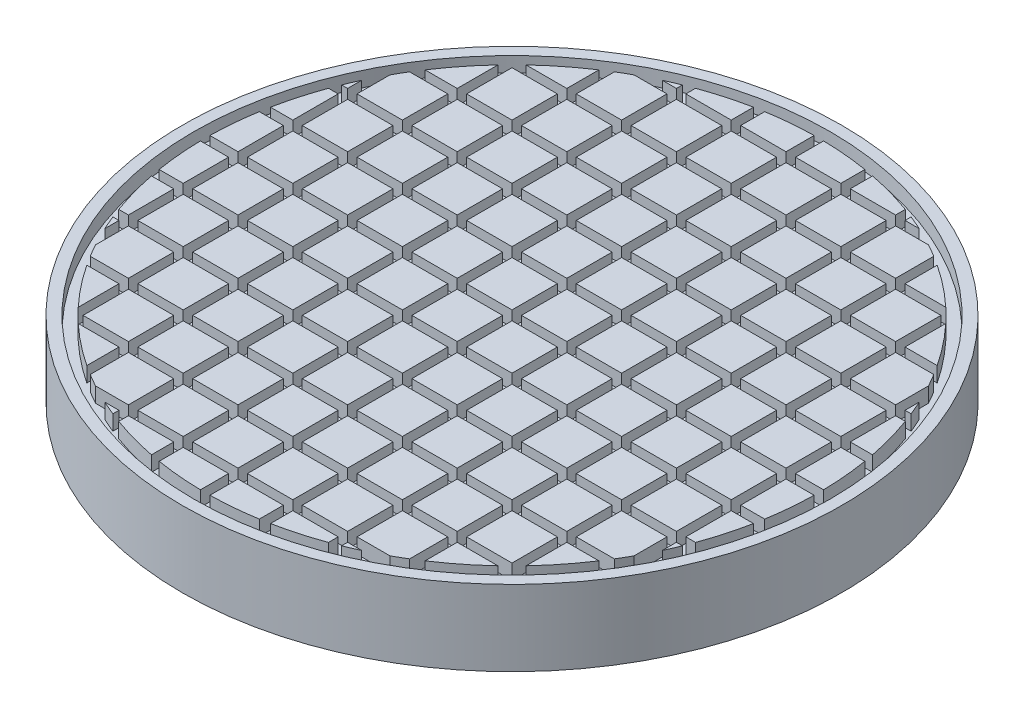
from build123d import *

# Parameters (mm, degrees)
SKETCH1_R               = 87.2
BOSS_EXTRUDE1_DEPTH     = 10
SKETCH2_W               = 165.4
SKETCH2_H               = 2.5
SKETCH2_W_2             = 162.837833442
SKETCH2_W_3             = 154.89725627
SKETCH2_W_4             = 140.670394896
SKETCH2_W_5             = 117.903180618
SKETCH2_W_6             = 79.574870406
SKETCH2_W_7             = 2.5
SKETCH2_H_2             = 165.4
SKETCH2_H_3             = 162.837833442
SKETCH2_H_4             = 154.89725627
SKETCH2_H_5             = 140.670394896
SKETCH2_H_6             = 117.903180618
SKETCH2_H_7             = 79.574870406
CUT_EXTRUDE_THIN2_DEPTH = 4
SKETCH5_R               = 84.2
SKETCH5_R_2             = 81.2
CUT_EXTRUDE_THIN3_DEPTH = 4


with BuildPart() as part:
    # Sketch1 → Boss-Extrude1 (new, symmetric)
    with BuildSketch(Plane(origin=(0, 0, 0), x_dir=(1, 0, 0), z_dir=(0, 1, 0))):
        with Locations(Location((0, 0, 0), (0, 0, 270))):
            Circle(SKETCH1_R)
    extrude(amount=BOSS_EXTRUDE1_DEPTH, both=True)

    # Sketch2 → Cut-Extrude-Thin2 (cut)
    with BuildSketch(Plane(origin=(0, 10, 0), x_dir=(1, 0, 0), z_dir=(0, 1, 0))):
        Rectangle(SKETCH2_W, SKETCH2_H)
        with Locations((0, 14.5)):
            Rectangle(SKETCH2_W_2, SKETCH2_H)
        with Locations((0, 29)):
            Rectangle(SKETCH2_W_3, SKETCH2_H)
        with Locations((0, 43.5)):
            Rectangle(SKETCH2_W_4, SKETCH2_H)
        with Locations((0, 58)):
            Rectangle(SKETCH2_W_5, SKETCH2_H)
        with Locations((0, 72.5)):
            Rectangle(SKETCH2_W_6, SKETCH2_H)
        Rectangle(SKETCH2_W_7, SKETCH2_H_2)
        with Locations((14.5, 0)):
            Rectangle(SKETCH2_W_7, SKETCH2_H_3)
        with Locations((29, 0)):
            Rectangle(SKETCH2_W_7, SKETCH2_H_4)
        with Locations((43.5, 0)):
            Rectangle(SKETCH2_W_7, SKETCH2_H_5)
        with Locations((58, 0)):
            Rectangle(SKETCH2_W_7, SKETCH2_H_6)
        with Locations((72.5, 0)):
            Rectangle(SKETCH2_W_7, SKETCH2_H_7)
        with Locations((-14.5, 0)):
            Rectangle(SKETCH2_W_7, SKETCH2_H_3)
        with Locations((-29, 0)):
            Rectangle(SKETCH2_W_7, SKETCH2_H_4)
        with Locations((-43.5, 0)):
            Rectangle(SKETCH2_W_7, SKETCH2_H_5)
        with Locations((-58, 0)):
            Rectangle(SKETCH2_W_7, SKETCH2_H_6)
        with Locations((-72.5, 0)):
            Rectangle(SKETCH2_W_7, SKETCH2_H_7)
        with Locations((0, -14.5)):
            Rectangle(SKETCH2_W_2, SKETCH2_H)
        with Locations((0, -29)):
            Rectangle(SKETCH2_W_3, SKETCH2_H)
        with Locations((0, -43.5)):
            Rectangle(SKETCH2_W_4, SKETCH2_H)
        with Locations((0, -58)):
            Rectangle(SKETCH2_W_5, SKETCH2_H)
        with Locations((0, -72.5)):
            Rectangle(SKETCH2_W_6, SKETCH2_H)
    extrude(amount=-CUT_EXTRUDE_THIN2_DEPTH, mode=Mode.SUBTRACT)

    # Sketch5 → Cut-Extrude-Thin3 (cut)
    with BuildSketch(Plane(origin=(0, 10, 0), x_dir=(1, 0, 0), z_dir=(0, 1, 0))):
        Circle(SKETCH5_R)
        Circle(SKETCH5_R_2, mode=Mode.SUBTRACT)
    extrude(amount=-CUT_EXTRUDE_THIN3_DEPTH, mode=Mode.SUBTRACT)


solid = part.part
